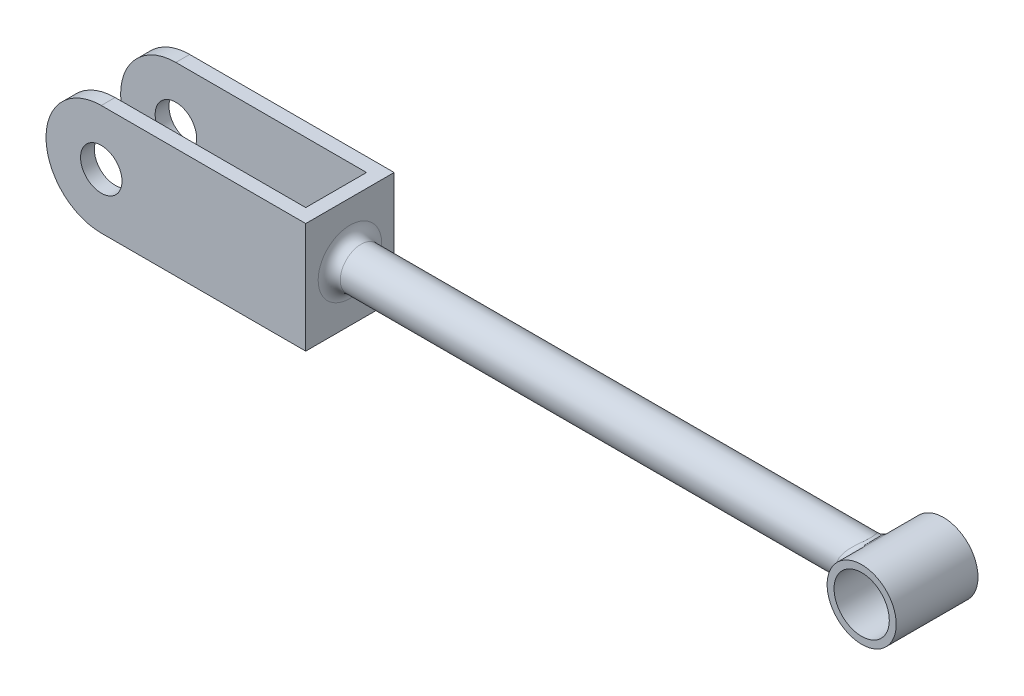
ISO-10303-21;
HEADER;
FILE_DESCRIPTION(('STEP AP214'),'2;1');
FILE_NAME('part.step','',(''),(''),'','','');
FILE_SCHEMA(('AUTOMOTIVE_DESIGN { 1 0 10303 214 1 1 1 1 }'));
ENDSEC;
DATA;
#1=APPLICATION_CONTEXT('core data for automotive mechanical design processes');
#2=APPLICATION_PROTOCOL_DEFINITION('international standard','automotive_design',2000,#1);
#3=PRODUCT_CONTEXT('',#1,'mechanical');
#4=PRODUCT('Part','Part','',(#3));
#5=PRODUCT_RELATED_PRODUCT_CATEGORY('part','',(#4));
#6=PRODUCT_DEFINITION_FORMATION('','',#4);
#7=PRODUCT_DEFINITION_CONTEXT('part definition',#1,'design');
#8=PRODUCT_DEFINITION('design','',#6,#7);
#9=PRODUCT_DEFINITION_SHAPE('','',#8);
#10=(LENGTH_UNIT() NAMED_UNIT(*) SI_UNIT(.MILLI.,.METRE.));
#11=(NAMED_UNIT(*) PLANE_ANGLE_UNIT() SI_UNIT($,.RADIAN.));
#12=(NAMED_UNIT(*) SI_UNIT($,.STERADIAN.) SOLID_ANGLE_UNIT());
#13=UNCERTAINTY_MEASURE_WITH_UNIT(LENGTH_MEASURE(1.E-05),#10,'distance_accuracy_value','');
#14=(GEOMETRIC_REPRESENTATION_CONTEXT(3) GLOBAL_UNCERTAINTY_ASSIGNED_CONTEXT((#13)) GLOBAL_UNIT_ASSIGNED_CONTEXT((#10,
#11,#12)) REPRESENTATION_CONTEXT('',''));
#15=CARTESIAN_POINT('',(0.,0.,0.));
#16=DIRECTION('',(0.,0.,1.));
#17=DIRECTION('',(1.,0.,0.));
#18=AXIS2_PLACEMENT_3D('',#15,#16,#17);
#19=CARTESIAN_POINT('',(0.,-6.35,5.08));
#20=DIRECTION('',(-1.,0.,0.));
#21=DIRECTION('',(0.,0.,1.));
#22=AXIS2_PLACEMENT_3D('',#19,#20,#21);
#23=PLANE('',#22);
#24=CARTESIAN_POINT('',(0.,0.,0.));
#25=DIRECTION('',(-1.,0.,0.));
#26=DIRECTION('',(0.,0.,1.));
#27=AXIS2_PLACEMENT_3D('',#24,#25,#26);
#28=CIRCLE('',#27,3.65125);
#29=CARTESIAN_POINT('',(0.,0.,3.65125));
#30=VERTEX_POINT('',#29);
#31=EDGE_CURVE('E11',#30,#30,#28,.T.);
#32=ORIENTED_EDGE('',*,*,#31,.T.);
#33=EDGE_LOOP('',(#32));
#34=FACE_BOUND('',#33,.T.);
#35=DIRECTION('',(0.,1.,0.));
#36=VECTOR('',#35,1.);
#37=CARTESIAN_POINT('',(0.,-6.35,-5.08));
#38=LINE('',#37,#36);
#39=CARTESIAN_POINT('',(0.,-6.35,-5.08));
#40=VERTEX_POINT('',#39);
#41=CARTESIAN_POINT('',(0.,6.35,-5.08));
#42=VERTEX_POINT('',#41);
#43=EDGE_CURVE('E143',#40,#42,#38,.T.);
#44=ORIENTED_EDGE('',*,*,#43,.T.);
#45=DIRECTION('',(0.,0.,-1.));
#46=VECTOR('',#45,1.);
#47=CARTESIAN_POINT('',(0.,6.35,5.08));
#48=LINE('',#47,#46);
#49=CARTESIAN_POINT('',(0.,6.35,5.08));
#50=VERTEX_POINT('',#49);
#51=EDGE_CURVE('E170',#50,#42,#48,.T.);
#52=ORIENTED_EDGE('',*,*,#51,.F.);
#53=DIRECTION('',(0.,1.,0.));
#54=VECTOR('',#53,1.);
#55=CARTESIAN_POINT('',(0.,-6.35,5.08));
#56=LINE('',#55,#54);
#57=CARTESIAN_POINT('',(0.,-6.35,5.08));
#58=VERTEX_POINT('',#57);
#59=EDGE_CURVE('E153',#58,#50,#56,.T.);
#60=ORIENTED_EDGE('',*,*,#59,.F.);
#61=DIRECTION('',(0.,0.,-1.));
#62=VECTOR('',#61,1.);
#63=CARTESIAN_POINT('',(0.,-6.35,5.08));
#64=LINE('',#63,#62);
#65=EDGE_CURVE('E160',#58,#40,#64,.T.);
#66=ORIENTED_EDGE('',*,*,#65,.T.);
#67=EDGE_LOOP('',(#44,#52,#60,#66));
#68=FACE_BOUND('',#67,.T.);
#69=ADVANCED_FACE('F32',(#34,#68),#23,.F.);
#70=CARTESIAN_POINT('',(-23.495,0.,5.08));
#71=DIRECTION('',(0.,0.,-1.));
#72=DIRECTION('',(-1.,0.,0.));
#73=AXIS2_PLACEMENT_3D('',#70,#71,#72);
#74=CYLINDRICAL_SURFACE('',#73,6.35);
#75=DIRECTION('',(0.,0.,-1.));
#76=VECTOR('',#75,1.);
#77=CARTESIAN_POINT('',(-23.495,6.35000000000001,5.08));
#78=LINE('',#77,#76);
#79=CARTESIAN_POINT('',(-23.495,6.35000000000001,5.08));
#80=VERTEX_POINT('',#79);
#81=CARTESIAN_POINT('',(-23.495,6.35,3.4925));
#82=VERTEX_POINT('',#81);
#83=EDGE_CURVE('E167',#80,#82,#78,.T.);
#84=ORIENTED_EDGE('',*,*,#83,.T.);
#85=CARTESIAN_POINT('',(-23.495,0.,3.4925));
#86=DIRECTION('',(0.,0.,1.));
#87=DIRECTION('',(1.,0.,0.));
#88=AXIS2_PLACEMENT_3D('',#85,#86,#87);
#89=CIRCLE('',#88,6.35);
#90=CARTESIAN_POINT('',(-23.495,-6.35,3.4925));
#91=VERTEX_POINT('',#90);
#92=EDGE_CURVE('E135',#82,#91,#89,.T.);
#93=ORIENTED_EDGE('',*,*,#92,.T.);
#94=DIRECTION('',(0.,0.,-1.));
#95=VECTOR('',#94,1.);
#96=CARTESIAN_POINT('',(-23.495,-6.34999999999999,5.08));
#97=LINE('',#96,#95);
#98=CARTESIAN_POINT('',(-23.495,-6.34999999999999,5.08));
#99=VERTEX_POINT('',#98);
#100=EDGE_CURVE('E164',#99,#91,#97,.T.);
#101=ORIENTED_EDGE('',*,*,#100,.F.);
#102=CARTESIAN_POINT('',(-23.495,0.,5.08));
#103=DIRECTION('',(0.,0.,1.));
#104=DIRECTION('',(1.,0.,0.));
#105=AXIS2_PLACEMENT_3D('',#102,#103,#104);
#106=CIRCLE('',#105,6.35);
#107=EDGE_CURVE('E157',#80,#99,#106,.T.);
#108=ORIENTED_EDGE('',*,*,#107,.F.);
#109=EDGE_LOOP('',(#84,#93,#101,#108));
#110=FACE_BOUND('',#109,.T.);
#111=ADVANCED_FACE('F230',(#110),#74,.T.);
#112=CARTESIAN_POINT('',(-23.495,0.,5.08));
#113=DIRECTION('',(0.,0.,-1.));
#114=DIRECTION('',(-1.,0.,0.));
#115=AXIS2_PLACEMENT_3D('',#112,#113,#114);
#116=CYLINDRICAL_SURFACE('',#115,2.38125);
#117=CARTESIAN_POINT('',(-23.495,0.,3.4925));
#118=DIRECTION('',(0.,0.,1.));
#119=DIRECTION('',(1.,0.,0.));
#120=AXIS2_PLACEMENT_3D('',#117,#118,#119);
#121=CIRCLE('',#120,2.38125);
#122=CARTESIAN_POINT('',(-21.11375,0.,3.4925));
#123=VERTEX_POINT('',#122);
#124=EDGE_CURVE('E134',#123,#123,#121,.T.);
#125=ORIENTED_EDGE('',*,*,#124,.F.);
#126=EDGE_LOOP('',(#125));
#127=FACE_BOUND('',#126,.T.);
#128=CARTESIAN_POINT('',(-23.495,0.,5.08));
#129=DIRECTION('',(0.,0.,1.));
#130=DIRECTION('',(1.,0.,0.));
#131=AXIS2_PLACEMENT_3D('',#128,#129,#130);
#132=CIRCLE('',#131,2.38125);
#133=CARTESIAN_POINT('',(-21.11375,0.,5.08));
#134=VERTEX_POINT('',#133);
#135=EDGE_CURVE('E140',#134,#134,#132,.T.);
#136=ORIENTED_EDGE('',*,*,#135,.T.);
#137=EDGE_LOOP('',(#136));
#138=FACE_BOUND('',#137,.T.);
#139=ADVANCED_FACE('F235',(#127,#138),#116,.F.);
#140=CARTESIAN_POINT('',(-23.495,0.,5.08));
#141=DIRECTION('',(0.,0.,1.));
#142=DIRECTION('',(1.,0.,0.));
#143=AXIS2_PLACEMENT_3D('',#140,#141,#142);
#144=PLANE('',#143);
#145=ORIENTED_EDGE('',*,*,#59,.T.);
#146=DIRECTION('',(-1.,0.,0.));
#147=VECTOR('',#146,1.);
#148=CARTESIAN_POINT('',(0.,6.35,5.08));
#149=LINE('',#148,#147);
#150=EDGE_CURVE('E155',#50,#80,#149,.T.);
#151=ORIENTED_EDGE('',*,*,#150,.T.);
#152=ORIENTED_EDGE('',*,*,#107,.T.);
#153=DIRECTION('',(1.,0.,0.));
#154=VECTOR('',#153,1.);
#155=CARTESIAN_POINT('',(-23.495,-6.34999999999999,5.08));
#156=LINE('',#155,#154);
#157=EDGE_CURVE('E56',#99,#58,#156,.T.);
#158=ORIENTED_EDGE('',*,*,#157,.T.);
#159=EDGE_LOOP('',(#145,#151,#152,#158));
#160=FACE_BOUND('',#159,.T.);
#161=ORIENTED_EDGE('',*,*,#135,.F.);
#162=EDGE_LOOP('',(#161));
#163=FACE_BOUND('',#162,.T.);
#164=ADVANCED_FACE('F251',(#160,#163),#144,.T.);
#165=CARTESIAN_POINT('',(-23.495,0.,-5.08));
#166=DIRECTION('',(0.,0.,1.));
#167=DIRECTION('',(1.,0.,0.));
#168=AXIS2_PLACEMENT_3D('',#165,#166,#167);
#169=PLANE('',#168);
#170=ORIENTED_EDGE('',*,*,#43,.F.);
#171=DIRECTION('',(1.,0.,0.));
#172=VECTOR('',#171,1.);
#173=CARTESIAN_POINT('',(-23.495,-6.34999999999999,-5.08));
#174=LINE('',#173,#172);
#175=CARTESIAN_POINT('',(-23.495,-6.34999999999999,-5.08));
#176=VERTEX_POINT('',#175);
#177=EDGE_CURVE('E151',#176,#40,#174,.T.);
#178=ORIENTED_EDGE('',*,*,#177,.F.);
#179=CARTESIAN_POINT('',(-23.495,0.,-5.08));
#180=DIRECTION('',(0.,0.,1.));
#181=DIRECTION('',(1.,0.,0.));
#182=AXIS2_PLACEMENT_3D('',#179,#180,#181);
#183=CIRCLE('',#182,6.35);
#184=CARTESIAN_POINT('',(-23.495,6.35000000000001,-5.08));
#185=VERTEX_POINT('',#184);
#186=EDGE_CURVE('E148',#185,#176,#183,.T.);
#187=ORIENTED_EDGE('',*,*,#186,.F.);
#188=DIRECTION('',(-1.,0.,0.));
#189=VECTOR('',#188,1.);
#190=CARTESIAN_POINT('',(0.,6.35,-5.08));
#191=LINE('',#190,#189);
#192=EDGE_CURVE('E146',#42,#185,#191,.T.);
#193=ORIENTED_EDGE('',*,*,#192,.F.);
#194=EDGE_LOOP('',(#170,#178,#187,#193));
#195=FACE_BOUND('',#194,.T.);
#196=CARTESIAN_POINT('',(-23.495,0.,-5.08));
#197=DIRECTION('',(0.,0.,1.));
#198=DIRECTION('',(1.,0.,0.));
#199=AXIS2_PLACEMENT_3D('',#196,#197,#198);
#200=CIRCLE('',#199,2.38125);
#201=CARTESIAN_POINT('',(-21.11375,0.,-5.08));
#202=VERTEX_POINT('',#201);
#203=EDGE_CURVE('E137',#202,#202,#200,.T.);
#204=ORIENTED_EDGE('',*,*,#203,.T.);
#205=EDGE_LOOP('',(#204));
#206=FACE_BOUND('',#205,.T.);
#207=ADVANCED_FACE('F242',(#195,#206),#169,.F.);
#208=CARTESIAN_POINT('',(0.,6.35,5.08));
#209=DIRECTION('',(0.,-1.,0.));
#210=DIRECTION('',(1.,0.,0.));
#211=AXIS2_PLACEMENT_3D('',#208,#209,#210);
#212=PLANE('',#211);
#213=DIRECTION('',(0.,0.,-1.));
#214=VECTOR('',#213,1.);
#215=CARTESIAN_POINT('',(-1.5875,6.35,3.4925));
#216=LINE('',#215,#214);
#217=CARTESIAN_POINT('',(-1.5875,6.35,3.4925));
#218=VERTEX_POINT('',#217);
#219=CARTESIAN_POINT('',(-1.5875,6.35,-3.4925));
#220=VERTEX_POINT('',#219);
#221=EDGE_CURVE('E112',#218,#220,#216,.T.);
#222=ORIENTED_EDGE('',*,*,#221,.F.);
#223=DIRECTION('',(1.,0.,0.));
#224=VECTOR('',#223,1.);
#225=CARTESIAN_POINT('',(-29.845,6.35,3.4925));
#226=LINE('',#225,#224);
#227=EDGE_CURVE('E121',#82,#218,#226,.T.);
#228=ORIENTED_EDGE('',*,*,#227,.F.);
#229=ORIENTED_EDGE('',*,*,#83,.F.);
#230=ORIENTED_EDGE('',*,*,#150,.F.);
#231=ORIENTED_EDGE('',*,*,#51,.T.);
#232=ORIENTED_EDGE('',*,*,#192,.T.);
#233=CARTESIAN_POINT('',(-23.495,6.35,-3.4925));
#234=VERTEX_POINT('',#233);
#235=EDGE_CURVE('E120',#234,#185,#78,.T.);
#236=ORIENTED_EDGE('',*,*,#235,.F.);
#237=DIRECTION('',(-1.,0.,0.));
#238=VECTOR('',#237,1.);
#239=CARTESIAN_POINT('',(-1.5875,6.35,-3.4925));
#240=LINE('',#239,#238);
#241=EDGE_CURVE('E101',#220,#234,#240,.T.);
#242=ORIENTED_EDGE('',*,*,#241,.F.);
#243=EDGE_LOOP('',(#222,#228,#229,#230,#231,#232,#236,#242));
#244=FACE_BOUND('',#243,.T.);
#245=ADVANCED_FACE('F118',(#244),#212,.F.);
#246=CARTESIAN_POINT('',(-23.495,0.,-3.4925));
#247=DIRECTION('',(0.,0.,-1.));
#248=DIRECTION('',(-1.,0.,0.));
#249=AXIS2_PLACEMENT_3D('',#246,#247,#248);
#250=CIRCLE('',#249,6.35);
#251=CARTESIAN_POINT('',(-23.495,-6.34999999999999,-3.4925));
#252=VERTEX_POINT('',#251);
#253=EDGE_CURVE('E48',#252,#234,#250,.T.);
#254=ORIENTED_EDGE('',*,*,#253,.T.);
#255=ORIENTED_EDGE('',*,*,#235,.T.);
#256=ORIENTED_EDGE('',*,*,#186,.T.);
#257=EDGE_CURVE('E163',#252,#176,#97,.T.);
#258=ORIENTED_EDGE('',*,*,#257,.F.);
#259=EDGE_LOOP('',(#254,#255,#256,#258));
#260=FACE_BOUND('',#259,.T.);
#261=ADVANCED_FACE('F238',(#260),#74,.T.);
#262=CARTESIAN_POINT('',(-23.495,-6.34999999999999,5.08));
#263=DIRECTION('',(0.,1.,0.));
#264=DIRECTION('',(-1.,0.,0.));
#265=AXIS2_PLACEMENT_3D('',#262,#263,#264);
#266=PLANE('',#265);
#267=ORIENTED_EDGE('',*,*,#100,.T.);
#268=DIRECTION('',(1.,0.,0.));
#269=VECTOR('',#268,1.);
#270=CARTESIAN_POINT('',(-29.845,-6.35,3.4925));
#271=LINE('',#270,#269);
#272=CARTESIAN_POINT('',(-1.5875,-6.35,3.4925));
#273=VERTEX_POINT('',#272);
#274=EDGE_CURVE('E108',#91,#273,#271,.T.);
#275=ORIENTED_EDGE('',*,*,#274,.T.);
#276=DIRECTION('',(0.,0.,-1.));
#277=VECTOR('',#276,1.);
#278=CARTESIAN_POINT('',(-1.5875,-6.35,3.4925));
#279=LINE('',#278,#277);
#280=CARTESIAN_POINT('',(-1.5875,-6.35,-3.4925));
#281=VERTEX_POINT('',#280);
#282=EDGE_CURVE('E123',#273,#281,#279,.T.);
#283=ORIENTED_EDGE('',*,*,#282,.T.);
#284=DIRECTION('',(-1.,0.,0.));
#285=VECTOR('',#284,1.);
#286=CARTESIAN_POINT('',(-1.5875,-6.35,-3.4925));
#287=LINE('',#286,#285);
#288=EDGE_CURVE('E103',#281,#252,#287,.T.);
#289=ORIENTED_EDGE('',*,*,#288,.T.);
#290=ORIENTED_EDGE('',*,*,#257,.T.);
#291=ORIENTED_EDGE('',*,*,#177,.T.);
#292=ORIENTED_EDGE('',*,*,#65,.F.);
#293=ORIENTED_EDGE('',*,*,#157,.F.);
#294=EDGE_LOOP('',(#267,#275,#283,#289,#290,#291,#292,#293));
#295=FACE_BOUND('',#294,.T.);
#296=ADVANCED_FACE('F245',(#295),#266,.F.);
#297=CARTESIAN_POINT('',(-23.495,0.,-3.4925));
#298=DIRECTION('',(0.,0.,-1.));
#299=DIRECTION('',(-1.,0.,0.));
#300=AXIS2_PLACEMENT_3D('',#297,#298,#299);
#301=CIRCLE('',#300,2.38125);
#302=CARTESIAN_POINT('',(-25.87625,0.,-3.4925));
#303=VERTEX_POINT('',#302);
#304=EDGE_CURVE('E131',#303,#303,#301,.T.);
#305=ORIENTED_EDGE('',*,*,#304,.F.);
#306=EDGE_LOOP('',(#305));
#307=FACE_BOUND('',#306,.T.);
#308=ORIENTED_EDGE('',*,*,#203,.F.);
#309=EDGE_LOOP('',(#308));
#310=FACE_BOUND('',#309,.T.);
#311=ADVANCED_FACE('F249',(#307,#310),#116,.F.);
#312=CARTESIAN_POINT('',(-29.845,-6.35,3.4925));
#313=DIRECTION('',(0.,0.,1.));
#314=DIRECTION('',(1.,0.,0.));
#315=AXIS2_PLACEMENT_3D('',#312,#313,#314);
#316=PLANE('',#315);
#317=ORIENTED_EDGE('',*,*,#124,.T.);
#318=EDGE_LOOP('',(#317));
#319=FACE_BOUND('',#318,.T.);
#320=ORIENTED_EDGE('',*,*,#227,.T.);
#321=DIRECTION('',(0.,1.,0.));
#322=VECTOR('',#321,1.);
#323=CARTESIAN_POINT('',(-1.5875,-6.35,3.4925));
#324=LINE('',#323,#322);
#325=EDGE_CURVE('E107',#273,#218,#324,.T.);
#326=ORIENTED_EDGE('',*,*,#325,.F.);
#327=ORIENTED_EDGE('',*,*,#274,.F.);
#328=ORIENTED_EDGE('',*,*,#92,.F.);
#329=EDGE_LOOP('',(#320,#326,#327,#328));
#330=FACE_BOUND('',#329,.T.);
#331=ADVANCED_FACE('F259',(#319,#330),#316,.F.);
#332=CARTESIAN_POINT('',(-1.5875,-6.35,-3.4925));
#333=DIRECTION('',(0.,0.,-1.));
#334=DIRECTION('',(-1.,0.,0.));
#335=AXIS2_PLACEMENT_3D('',#332,#333,#334);
#336=PLANE('',#335);
#337=ORIENTED_EDGE('',*,*,#304,.T.);
#338=EDGE_LOOP('',(#337));
#339=FACE_BOUND('',#338,.T.);
#340=ORIENTED_EDGE('',*,*,#253,.F.);
#341=ORIENTED_EDGE('',*,*,#288,.F.);
#342=DIRECTION('',(0.,1.,0.));
#343=VECTOR('',#342,1.);
#344=CARTESIAN_POINT('',(-1.5875,-6.35,-3.4925));
#345=LINE('',#344,#343);
#346=EDGE_CURVE('E97',#281,#220,#345,.T.);
#347=ORIENTED_EDGE('',*,*,#346,.T.);
#348=ORIENTED_EDGE('',*,*,#241,.T.);
#349=EDGE_LOOP('',(#340,#341,#347,#348));
#350=FACE_BOUND('',#349,.T.);
#351=ADVANCED_FACE('F99',(#339,#350),#336,.F.);
#352=CARTESIAN_POINT('',(-1.5875,-6.35,3.4925));
#353=DIRECTION('',(1.,0.,0.));
#354=DIRECTION('',(0.,1.,0.));
#355=AXIS2_PLACEMENT_3D('',#352,#353,#354);
#356=PLANE('',#355);
#357=ORIENTED_EDGE('',*,*,#221,.T.);
#358=ORIENTED_EDGE('',*,*,#346,.F.);
#359=ORIENTED_EDGE('',*,*,#282,.F.);
#360=ORIENTED_EDGE('',*,*,#325,.T.);
#361=EDGE_LOOP('',(#357,#358,#359,#360));
#362=FACE_BOUND('',#361,.T.);
#363=ADVANCED_FACE('F113',(#362),#356,.F.);
#364=CARTESIAN_POINT('',(500000.,0.,0.));
#365=DIRECTION('',(-1.,0.,0.));
#366=DIRECTION('',(0.,0.,1.));
#367=AXIS2_PLACEMENT_3D('',#364,#365,#366);
#368=CYLINDRICAL_SURFACE('',#367,2.38125);
#369=CARTESIAN_POINT('',(58.2709890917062,-0.208232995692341,2.37212785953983));
#370=CARTESIAN_POINT('',(59.5319077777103,-0.131828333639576,2.37883490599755));
#371=CARTESIAN_POINT('',(59.5386280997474,-0.241886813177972,3.63726271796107));
#372=CARTESIAN_POINT('',(58.260263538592,-0.0936722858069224,2.38218402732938));
#373=CARTESIAN_POINT('',(59.5311098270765,-0.057961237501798,2.38160074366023));
#374=CARTESIAN_POINT('',(59.5305026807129,-0.108811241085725,3.65268217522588));
#375=CARTESIAN_POINT('',(58.2583906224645,0.0219828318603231,2.38392963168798));
#376=CARTESIAN_POINT('',(59.5310409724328,0.0132069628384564,2.38198214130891));
#377=CARTESIAN_POINT('',(59.5290838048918,0.0255356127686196,3.65535876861));
#378=CARTESIAN_POINT('',(58.2725269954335,0.25186834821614,2.37069041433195));
#379=CARTESIAN_POINT('',(59.5319989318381,0.159137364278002,2.37847493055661));
#380=CARTESIAN_POINT('',(59.5397931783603,0.292574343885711,3.6350586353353));
#381=CARTESIAN_POINT('',(58.2885396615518,0.366098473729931,2.35570243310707));
#382=CARTESIAN_POINT('',(59.5330170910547,0.233176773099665,2.37461895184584));
#383=CARTESIAN_POINT('',(59.5519239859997,0.425265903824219,3.61207706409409));
#384=CARTESIAN_POINT('',(58.3360016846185,0.585250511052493,2.31081242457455));
#385=CARTESIAN_POINT('',(59.5386916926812,0.386873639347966,2.35933572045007));
#386=CARTESIAN_POINT('',(59.5878800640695,0.679836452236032,3.54324571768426));
#387=CARTESIAN_POINT('',(58.3668075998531,0.690361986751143,2.28153128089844));
#388=CARTESIAN_POINT('',(59.5431358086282,0.465474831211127,2.34836778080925));
#389=CARTESIAN_POINT('',(59.6112178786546,0.80193564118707,3.4983479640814));
#390=CARTESIAN_POINT('',(58.4411821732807,0.893888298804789,2.20974440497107));
#391=CARTESIAN_POINT('',(59.5585884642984,0.631024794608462,2.31472912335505));
#392=CARTESIAN_POINT('',(59.6675622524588,1.03835509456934,3.38827475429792));
#393=CARTESIAN_POINT('',(58.4847532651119,0.992301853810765,2.16723615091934));
#394=CARTESIAN_POINT('',(59.5694389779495,0.71738718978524,2.29235621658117));
#395=CARTESIAN_POINT('',(59.7005706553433,1.15267387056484,3.32309543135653));
#396=CARTESIAN_POINT('',(58.5864196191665,1.1899596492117,2.06587688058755));
#397=CARTESIAN_POINT('',(59.6010898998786,0.903660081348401,2.22968579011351));
#398=CARTESIAN_POINT('',(59.7775906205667,1.38227636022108,3.16767788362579));
#399=CARTESIAN_POINT('',(58.6455071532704,1.28837811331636,2.00584937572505));
#400=CARTESIAN_POINT('',(59.6224931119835,1.00381365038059,2.18832513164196));
#401=CARTESIAN_POINT('',(59.8223539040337,1.49660083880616,3.07563570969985));
#402=CARTESIAN_POINT('',(58.7715019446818,1.47427643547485,1.8734735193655));
#403=CARTESIAN_POINT('',(59.6756463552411,1.20435297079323,2.08536613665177));
#404=CARTESIAN_POINT('',(59.9178045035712,1.7125433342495,2.87265939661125));
#405=CARTESIAN_POINT('',(58.8384166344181,1.56174573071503,1.80111342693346));
#406=CARTESIAN_POINT('',(59.7071203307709,1.30462894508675,2.02430722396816));
#407=CARTESIAN_POINT('',(59.9684974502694,1.81414908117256,2.76170725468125));
#408=CARTESIAN_POINT('',(58.9474371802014,1.6913499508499,1.67752497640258));
#409=CARTESIAN_POINT('',(59.76371146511,1.45997470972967,1.91085127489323));
#410=CARTESIAN_POINT('',(60.0510887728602,1.96469943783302,2.57220496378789));
#411=CARTESIAN_POINT('',(58.9884283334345,1.73733500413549,1.62984456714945));
#412=CARTESIAN_POINT('',(59.7859046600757,1.51627290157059,1.86567753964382));
#413=CARTESIAN_POINT('',(60.0821426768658,2.01811641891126,2.499095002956));
#414=CARTESIAN_POINT('',(59.0706382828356,1.82509397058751,1.53093161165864));
#415=CARTESIAN_POINT('',(59.8322220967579,1.62576644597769,1.7687260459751));
#416=CARTESIAN_POINT('',(60.1444229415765,2.12005865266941,2.34742847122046));
#417=CARTESIAN_POINT('',(59.1118568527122,1.86687147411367,1.47970215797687));
#418=CARTESIAN_POINT('',(59.8563310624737,1.67903666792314,1.71701734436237));
#419=CARTESIAN_POINT('',(60.1756491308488,2.16858807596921,2.26887664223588));
#420=CARTESIAN_POINT('',(59.234519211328,1.98581949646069,1.32075566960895));
#421=CARTESIAN_POINT('',(59.9299305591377,1.83200022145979,1.55315866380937));
#422=CARTESIAN_POINT('',(60.2685751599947,2.30676002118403,2.02515869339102));
#423=CARTESIAN_POINT('',(59.3149770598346,2.05661398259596,1.20777243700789));
#424=CARTESIAN_POINT('',(59.9816762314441,1.92735872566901,1.43038088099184));
#425=CARTESIAN_POINT('',(60.3295280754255,2.3889960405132,1.85191773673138));
#426=CARTESIAN_POINT('',(59.4502058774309,2.16825711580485,0.990512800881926));
#427=CARTESIAN_POINT('',(60.0718520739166,2.08000383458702,1.18551734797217));
#428=CARTESIAN_POINT('',(60.4319741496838,2.5186825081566,1.51878629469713));
#429=CARTESIAN_POINT('',(59.5069909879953,2.21220578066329,0.888355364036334));
#430=CARTESIAN_POINT('',(60.1110722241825,2.14137639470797,1.06756271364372));
#431=CARTESIAN_POINT('',(60.4749931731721,2.56973398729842,1.36214489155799));
#432=CARTESIAN_POINT('',(59.6058735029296,2.28595545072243,0.676237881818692));
#433=CARTESIAN_POINT('',(60.1803523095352,2.24485946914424,0.818508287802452));
#434=CARTESIAN_POINT('',(60.5499041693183,2.65540279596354,1.03689808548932));
#435=CARTESIAN_POINT('',(59.6480016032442,2.31578607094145,0.566294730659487));
#436=CARTESIAN_POINT('',(60.2106938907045,2.28747148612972,0.687063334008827));
#437=CARTESIAN_POINT('',(60.5818193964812,2.69005452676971,0.868318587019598));
#438=CARTESIAN_POINT('',(59.706021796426,2.35612352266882,0.358362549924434));
#439=CARTESIAN_POINT('',(60.2526356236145,2.34506795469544,0.436446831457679));
#440=CARTESIAN_POINT('',(60.6257740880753,2.73691116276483,0.549489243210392));
#441=CARTESIAN_POINT('',(59.7249865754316,2.36892280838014,0.261192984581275));
#442=CARTESIAN_POINT('',(60.2665600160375,2.36352630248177,0.318264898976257));
#443=CARTESIAN_POINT('',(60.6401413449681,2.75177901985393,0.4004959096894));
#444=CARTESIAN_POINT('',(59.7449364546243,2.38237550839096,0.0652585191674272));
#445=CARTESIAN_POINT('',(60.281151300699,2.38285004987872,0.0797731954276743));
#446=CARTESIAN_POINT('',(60.6552548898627,2.76740589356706,0.100063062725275));
#447=CARTESIAN_POINT('',(59.7459354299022,2.38303829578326,-0.0335050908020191));
#448=CARTESIAN_POINT('',(60.2818895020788,2.38380999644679,-0.0410269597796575));
#449=CARTESIAN_POINT('',(60.6560116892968,2.76817579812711,-0.0513744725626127));
#450=CARTESIAN_POINT('',(59.7298232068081,2.3721905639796,-0.229562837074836));
#451=CARTESIAN_POINT('',(60.2700984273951,2.36822213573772,-0.279784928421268));
#452=CARTESIAN_POINT('',(60.6438054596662,2.755574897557,-0.351996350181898));
#453=CARTESIAN_POINT('',(59.7127348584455,2.36069540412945,-0.326858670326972));
#454=CARTESIAN_POINT('',(60.2575362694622,2.35163087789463,-0.398243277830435));
#455=CARTESIAN_POINT('',(60.6308597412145,2.74222193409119,-0.501183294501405));
#456=CARTESIAN_POINT('',(59.6630561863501,2.32631856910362,-0.517715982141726));
#457=CARTESIAN_POINT('',(60.2215736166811,2.30252748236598,-0.628540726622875));
#458=CARTESIAN_POINT('',(60.5932243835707,2.70228924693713,-0.793831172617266));
#459=CARTESIAN_POINT('',(59.6304436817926,2.30342059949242,-0.611271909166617));
#460=CARTESIAN_POINT('',(60.1980235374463,2.26980279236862,-0.740774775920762));
#461=CARTESIAN_POINT('',(60.5685179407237,2.67569059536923,-0.937283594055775));
#462=CARTESIAN_POINT('',(59.5396525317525,2.23708828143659,-0.826222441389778));
#463=CARTESIAN_POINT('',(60.1337089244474,2.1760769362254,-0.995542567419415));
#464=CARTESIAN_POINT('',(60.499736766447,2.59863790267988,-1.26687441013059));
#465=CARTESIAN_POINT('',(59.4764881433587,2.1892111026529,-0.945339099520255));
#466=CARTESIAN_POINT('',(60.0895912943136,2.1087447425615,-1.13419912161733));
#467=CARTESIAN_POINT('',(60.4518849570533,2.54302299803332,-1.44951995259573));
#468=CARTESIAN_POINT('',(59.3385324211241,2.07663039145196,-1.1722073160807));
#469=CARTESIAN_POINT('',(59.9971686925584,1.95458190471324,-1.39080703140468));
#470=CARTESIAN_POINT('',(60.3473730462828,2.41224742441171,-1.79738455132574));
#471=CARTESIAN_POINT('',(59.2637200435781,2.01189625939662,-1.27993770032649));
#472=CARTESIAN_POINT('',(59.948556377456,1.86697304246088,-1.50892559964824));
#473=CARTESIAN_POINT('',(60.2906970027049,2.33705121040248,-1.96257114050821));
#474=CARTESIAN_POINT('',(59.1087418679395,1.86530930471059,-1.48568890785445));
#475=CARTESIAN_POINT('',(59.8534227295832,1.67549887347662,-1.72535172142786));
#476=CARTESIAN_POINT('',(60.1732892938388,2.16677343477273,-2.27805632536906));
#477=CARTESIAN_POINT('',(59.0284919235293,1.78309255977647,-1.58342480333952));
#478=CARTESIAN_POINT('',(59.806919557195,1.57066172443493,-1.82287618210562));
#479=CARTESIAN_POINT('',(60.1124938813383,2.07126913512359,-2.42791803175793));
#480=CARTESIAN_POINT('',(58.9107188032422,1.64850346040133,-1.71954989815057));
#481=CARTESIAN_POINT('',(59.7444429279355,1.40851686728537,-1.94973843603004));
#482=CARTESIAN_POINT('',(60.0232718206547,1.91492826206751,-2.63664317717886));
#483=CARTESIAN_POINT('',(58.8719078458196,1.60178140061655,-1.76316505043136));
#484=CARTESIAN_POINT('',(59.7246564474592,1.35304262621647,-1.98911049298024));
#485=CARTESIAN_POINT('',(59.9938695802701,1.8606551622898,-2.70351974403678));
#486=CARTESIAN_POINT('',(58.7958483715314,1.50459573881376,-1.84679718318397));
#487=CARTESIAN_POINT('',(59.6877871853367,1.24082222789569,-2.06169764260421));
#488=CARTESIAN_POINT('',(59.9362487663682,1.74776272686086,-2.83175568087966));
#489=CARTESIAN_POINT('',(58.7586018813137,1.45412750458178,-1.88680956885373));
#490=CARTESIAN_POINT('',(59.6707469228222,1.18405523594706,-2.09481583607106));
#491=CARTESIAN_POINT('',(59.9080317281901,1.68913801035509,-2.89310800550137));
#492=CARTESIAN_POINT('',(58.654702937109,1.30351490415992,-1.99649512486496));
#493=CARTESIAN_POINT('',(59.625869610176,1.01915353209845,-2.18184804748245));
#494=CARTESIAN_POINT('',(59.8293204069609,1.51418397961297,-3.06129252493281));
#495=CARTESIAN_POINT('',(58.5910570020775,1.1987815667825,-2.06123899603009));
#496=CARTESIAN_POINT('',(59.6025490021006,0.911885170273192,-2.22681112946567));
#497=CARTESIAN_POINT('',(59.7811037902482,1.39252404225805,-3.16056646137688));
#498=CARTESIAN_POINT('',(58.4773755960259,0.978148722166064,-2.17460576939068));
#499=CARTESIAN_POINT('',(59.5670343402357,0.703602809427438,-2.29710265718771));
#500=CARTESIAN_POINT('',(59.6949815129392,1.13623336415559,-3.33439551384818));
#501=CARTESIAN_POINT('',(58.4273206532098,0.86226551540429,-2.22325175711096));
#502=CARTESIAN_POINT('',(59.5551921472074,0.603183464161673,-2.32179412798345));
#503=CARTESIAN_POINT('',(59.6570611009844,1.00162155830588,-3.40898602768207));
#504=CARTESIAN_POINT('',(58.350423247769,0.636888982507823,-2.29716759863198));
#505=CARTESIAN_POINT('',(59.5404562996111,0.424613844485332,-2.35467720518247));
#506=CARTESIAN_POINT('',(59.5988054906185,0.739820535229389,-3.5223236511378));
#507=CARTESIAN_POINT('',(58.3214571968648,0.528416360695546,-2.32460371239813));
#508=CARTESIAN_POINT('',(59.5367759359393,0.345751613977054,-2.36426924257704));
#509=CARTESIAN_POINT('',(59.5768615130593,0.613816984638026,-3.56439235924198));
#510=CARTESIAN_POINT('',(58.2797468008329,0.307549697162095,-2.36395334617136));
#511=CARTESIAN_POINT('',(59.532326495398,0.194538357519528,-2.37692720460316));
#512=CARTESIAN_POINT('',(59.5452627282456,0.357254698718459,-3.62472846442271));
#513=CARTESIAN_POINT('',(58.2669601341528,0.195166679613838,-2.37590736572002));
#514=CARTESIAN_POINT('',(59.5316007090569,0.122870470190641,-2.37988494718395));
#515=CARTESIAN_POINT('',(59.535575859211,0.226708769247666,-3.64305796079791));
#516=CARTESIAN_POINT('',(58.261770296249,0.0553686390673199,-2.38076274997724));
#517=CARTESIAN_POINT('',(59.5312845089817,0.0347799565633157,-2.38112166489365));
#518=CARTESIAN_POINT('',(59.5316441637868,0.0643171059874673,-3.65050288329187));
#519=CARTESIAN_POINT('',(58.2612624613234,0.0281824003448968,-2.38123835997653));
#520=CARTESIAN_POINT('',(59.5312506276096,0.0177047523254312,-2.38124721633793));
#521=CARTESIAN_POINT('',(59.5312594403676,0.0327371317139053,-3.65123215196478));
#522=CARTESIAN_POINT('',(58.2612379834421,-0.0261915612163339,-2.38126122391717));
#523=CARTESIAN_POINT('',(59.5312493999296,-0.0164540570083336,-2.38125267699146));
#524=CARTESIAN_POINT('',(59.5312408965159,-0.0304245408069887,-3.65126721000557));
#525=CARTESIAN_POINT('',(58.261721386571,-0.0533792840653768,-2.38080843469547));
#526=CARTESIAN_POINT('',(59.5312820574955,-0.0335284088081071,-2.38113257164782));
#527=CARTESIAN_POINT('',(59.5316071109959,-0.0620062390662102,-3.65057293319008));
#528=CARTESIAN_POINT('',(58.2670473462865,-0.200328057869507,-2.37582627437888));
#529=CARTESIAN_POINT('',(59.5316026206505,-0.12610590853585,-2.37986913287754));
#530=CARTESIAN_POINT('',(59.535641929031,-0.232704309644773,-3.64293362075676));
#531=CARTESIAN_POINT('',(58.2811309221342,-0.319852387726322,-2.36266328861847));
#532=CARTESIAN_POINT('',(59.5323778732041,-0.202327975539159,-2.37664730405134));
#533=CARTESIAN_POINT('',(59.5463113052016,-0.371545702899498,-3.6227503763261));
#534=CARTESIAN_POINT('',(58.3274559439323,-0.554289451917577,-2.31892647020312));
#535=CARTESIAN_POINT('',(59.5375145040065,-0.364036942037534,-2.36231270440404));
#536=CARTESIAN_POINT('',(59.5814060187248,-0.643871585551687,-3.55568725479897));
#537=CARTESIAN_POINT('',(58.3597485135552,-0.669188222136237,-2.28830361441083));
#538=CARTESIAN_POINT('',(59.5418189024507,-0.448700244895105,-2.35133912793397));
#539=CARTESIAN_POINT('',(59.6058700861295,-0.77733985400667,-3.50873220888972));
#540=CARTESIAN_POINT('',(58.4393176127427,-0.890442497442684,-2.21158069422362));
#541=CARTESIAN_POINT('',(59.5580528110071,-0.627592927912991,-2.31580570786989));
#542=CARTESIAN_POINT('',(59.6661497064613,-1.03435239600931,-3.3910903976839));
#543=CARTESIAN_POINT('',(58.4864993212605,-0.996846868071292,-2.16557846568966));
#544=CARTESIAN_POINT('',(59.5697361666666,-0.720993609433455,-2.29170612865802));
#545=CARTESIAN_POINT('',(59.7018934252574,-1.15795343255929,-3.3205536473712));
#546=CARTESIAN_POINT('',(58.592206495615,-1.19991728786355,-2.06001421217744));
#547=CARTESIAN_POINT('',(59.6031316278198,-0.913648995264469,-2.22570964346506));
#548=CARTESIAN_POINT('',(59.7819746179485,-1.39384331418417,-3.15868845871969));
#549=CARTESIAN_POINT('',(58.6507270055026,-1.29658756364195,-2.00045810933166));
#550=CARTESIAN_POINT('',(59.6245489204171,-1.01243599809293,-2.1843474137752));
#551=CARTESIAN_POINT('',(59.8263083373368,-1.50613706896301,-3.06736910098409));
#552=CARTESIAN_POINT('',(58.7813651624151,-1.48823110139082,-1.86300094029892));
#553=CARTESIAN_POINT('',(59.6799255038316,-1.21950841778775,-2.07707127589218));
#554=CARTESIAN_POINT('',(59.9252766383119,-1.7287532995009,-2.85660144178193));
#555=CARTESIAN_POINT('',(58.8542549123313,-1.58209356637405,-1.78386890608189));
#556=CARTESIAN_POINT('',(59.7146460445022,-1.32792594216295,-2.00966414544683));
#557=CARTESIAN_POINT('',(59.9804961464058,-1.83778545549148,-2.73526565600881));
#558=CARTESIAN_POINT('',(59.0036967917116,-1.75618074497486,-1.61279577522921));
#559=CARTESIAN_POINT('',(59.7931725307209,-1.53737127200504,-1.85121641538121));
#560=CARTESIAN_POINT('',(60.0937096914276,-2.04000793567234,-2.47295352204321));
#561=CARTESIAN_POINT('',(59.080255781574,-1.83637852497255,-1.52083001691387));
#562=CARTESIAN_POINT('',(59.8368084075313,-1.63870669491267,-1.76064658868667));
#563=CARTESIAN_POINT('',(60.1517089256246,-2.13316697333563,-2.33193935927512));
#564=CARTESIAN_POINT('',(59.2433863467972,-1.99423638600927,-1.30904802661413));
#565=CARTESIAN_POINT('',(59.93525673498,-1.84278559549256,-1.54110394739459));
#566=CARTESIAN_POINT('',(60.2752926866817,-2.31653721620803,-2.00720697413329));
#567=CARTESIAN_POINT('',(59.329530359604,-2.06930326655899,-1.18713947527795));
#568=CARTESIAN_POINT('',(59.9910071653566,-1.94432649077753,-1.40809010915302));
#569=CARTESIAN_POINT('',(60.3405533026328,-2.40373611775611,-1.82028052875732));
#570=CARTESIAN_POINT('',(59.4866282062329,-2.19746676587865,-0.928535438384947));
#571=CARTESIAN_POINT('',(60.0962558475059,-2.11983938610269,-1.11552357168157));
#572=CARTESIAN_POINT('',(60.4595668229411,-2.55261290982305,-1.42375433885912));
#573=CARTESIAN_POINT('',(59.5576225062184,-2.25062227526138,-0.791880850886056));
#574=CARTESIAN_POINT('',(60.1462103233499,-2.19497883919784,-0.955744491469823));
#575=CARTESIAN_POINT('',(60.5133503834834,-2.61435920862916,-1.21421730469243));
#576=CARTESIAN_POINT('',(59.6507951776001,-2.31785503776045,-0.55457290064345));
#577=CARTESIAN_POINT('',(60.212613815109,-2.29032791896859,-0.6730267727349));
#578=CARTESIAN_POINT('',(60.5839357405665,-2.69245787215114,-0.850345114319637));
#579=CARTESIAN_POINT('',(59.6813625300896,-2.33906755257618,-0.457354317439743));
#580=CARTESIAN_POINT('',(60.2348034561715,-2.32073104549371,-0.55591256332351));
#581=CARTESIAN_POINT('',(60.6070928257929,-2.71709867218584,-0.701276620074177));
#582=CARTESIAN_POINT('',(59.7252433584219,-2.36917516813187,-0.259483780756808));
#583=CARTESIAN_POINT('',(60.2666789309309,-2.36381541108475,-0.316451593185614));
#584=CARTESIAN_POINT('',(60.6403358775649,-2.75207216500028,-0.397875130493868));
#585=CARTESIAN_POINT('',(59.7385883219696,-2.37809274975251,-0.158838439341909));
#586=CARTESIAN_POINT('',(60.2765176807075,-2.37670906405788,-0.193647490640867));
#587=CARTESIAN_POINT('',(60.6504456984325,-2.76243097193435,-0.243552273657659));
#588=CARTESIAN_POINT('',(59.7459046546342,-2.38300732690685,0.0433725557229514));
#589=CARTESIAN_POINT('',(60.2818761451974,-2.38377483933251,0.0527933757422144));
#590=CARTESIAN_POINT('',(60.6559883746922,-2.76813982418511,0.0665045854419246));
#591=CARTESIAN_POINT('',(59.7398203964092,-2.37896722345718,0.144940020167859));
#592=CARTESIAN_POINT('',(60.2773789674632,-2.37792500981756,0.176985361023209));
#593=CARTESIAN_POINT('',(60.6513790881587,-2.76344677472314,0.22224136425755));
#594=CARTESIAN_POINT('',(59.7091998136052,-2.35820026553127,0.345621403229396));
#595=CARTESIAN_POINT('',(60.2550339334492,-2.34813133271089,0.420793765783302));
#596=CARTESIAN_POINT('',(60.6281816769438,-2.73932354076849,0.529952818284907));
#597=CARTESIAN_POINT('',(59.6846372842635,-2.34145539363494,0.444731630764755));
#598=CARTESIAN_POINT('',(60.2370701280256,-2.3240314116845,0.540919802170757));
#599=CARTESIAN_POINT('',(60.6095737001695,-2.71987242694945,0.681921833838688));
#600=CARTESIAN_POINT('',(59.6133951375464,-2.29117428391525,0.660104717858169));
#601=CARTESIAN_POINT('',(60.1858790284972,-2.25246145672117,0.799213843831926));
#602=CARTESIAN_POINT('',(60.5556023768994,-2.66146507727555,1.01216056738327));
#603=CARTESIAN_POINT('',(59.5629519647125,-2.25468199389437,0.775132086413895));
#604=CARTESIAN_POINT('',(60.1498763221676,-2.20056850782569,0.935624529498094));
#605=CARTESIAN_POINT('',(60.5173878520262,-2.61907504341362,1.18853586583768));
#606=CARTESIAN_POINT('',(59.4479640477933,-2.16629442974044,0.995848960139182));
#607=CARTESIAN_POINT('',(60.0704626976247,-2.07751111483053,1.19169247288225));
#608=CARTESIAN_POINT('',(60.4302757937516,-2.51640262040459,1.5269684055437));
#609=CARTESIAN_POINT('',(59.3833985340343,-2.11437642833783,1.1015243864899));
#610=CARTESIAN_POINT('',(60.0267406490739,-2.00573380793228,1.31167103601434));
#611=CARTESIAN_POINT('',(60.381362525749,-2.45609383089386,1.68900405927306));
#612=CARTESIAN_POINT('',(59.2459811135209,-1.99539194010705,1.30497026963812));
#613=CARTESIAN_POINT('',(59.9376516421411,-1.84566661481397,1.53557072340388));
#614=CARTESIAN_POINT('',(60.2772584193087,-2.31787952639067,2.00095441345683));
#615=CARTESIAN_POINT('',(59.1729779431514,-1.9280168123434,1.40251517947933));
#616=CARTESIAN_POINT('',(59.892108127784,-1.75647094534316,1.63905898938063));
#617=CARTESIAN_POINT('',(60.2219529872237,-2.23961548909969,2.15052327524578));
#618=CARTESIAN_POINT('',(59.0261093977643,-1.7797477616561,1.58644586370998));
#619=CARTESIAN_POINT('',(59.805877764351,-1.56740252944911,1.82554294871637));
#620=CARTESIAN_POINT('',(60.1106889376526,-2.06738376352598,2.43255032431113));
#621=CARTESIAN_POINT('',(58.9522436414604,-1.69884763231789,1.67282648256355));
#622=CARTESIAN_POINT('',(59.7652087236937,-1.46703936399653,1.90825211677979));
#623=CARTESIAN_POINT('',(60.0547300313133,-1.97340886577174,2.56500060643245));
#624=CARTESIAN_POINT('',(58.7935945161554,-1.50541419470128,1.85063183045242));
#625=CARTESIAN_POINT('',(59.6848306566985,-1.23827169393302,2.06825751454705));
#626=CARTESIAN_POINT('',(59.934541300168,-1.74871345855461,2.83763547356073));
#627=CARTESIAN_POINT('',(58.7098631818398,-1.38981711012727,1.93917140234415));
#628=CARTESIAN_POINT('',(59.64782251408,-1.10889014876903,2.13919127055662));
#629=CARTESIAN_POINT('',(59.8711084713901,-1.61443401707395,2.97339615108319));
#630=CARTESIAN_POINT('',(58.5579264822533,-1.14126377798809,2.09506161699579));
#631=CARTESIAN_POINT('',(59.5903007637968,-0.854012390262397,2.25073626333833));
#632=CARTESIAN_POINT('',(59.7560049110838,-1.32571044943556,3.21242781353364));
#633=CARTESIAN_POINT('',(58.489698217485,-1.00833359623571,2.16244356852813));
#634=CARTESIAN_POINT('',(59.5704071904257,-0.729065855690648,2.29019796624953));
#635=CARTESIAN_POINT('',(59.7043168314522,-1.17129660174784,3.31574680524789));
#636=CARTESIAN_POINT('',(58.3914017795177,-0.764458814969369,2.25797356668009));
#637=CARTESIAN_POINT('',(59.5474937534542,-0.52343099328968,2.33839411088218));
#638=CARTESIAN_POINT('',(59.6298498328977,-0.888007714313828,3.46222613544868));
#639=CARTESIAN_POINT('',(58.3560345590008,-0.656618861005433,2.29175171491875));
#640=CARTESIAN_POINT('',(59.5416400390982,-0.439801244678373,2.35208934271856));
#641=CARTESIAN_POINT('',(59.6030564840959,-0.762739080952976,3.5140192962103));
#642=CARTESIAN_POINT('',(58.3011830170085,-0.435623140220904,2.34380798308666));
#643=CARTESIAN_POINT('',(59.5341991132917,-0.280251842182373,2.37103303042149));
#644=CARTESIAN_POINT('',(59.5615022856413,-0.506026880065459,3.59383890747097));
#645=CARTESIAN_POINT('',(58.2816845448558,-0.322472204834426,2.362099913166));
#646=CARTESIAN_POINT('',(59.5326988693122,-0.205060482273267,2.37609284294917));
#647=CARTESIAN_POINT('',(59.5467307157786,-0.374588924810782,3.62188653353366));
#648=CARTESIAN_POINT('',(58.2709890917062,-0.208232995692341,2.37212785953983));
#649=CARTESIAN_POINT('',(59.5319077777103,-0.131828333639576,2.37883490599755));
#650=CARTESIAN_POINT('',(59.5386280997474,-0.241886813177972,3.63726271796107));
#651=(BOUNDED_SURFACE() B_SPLINE_SURFACE(3,2,((#369,#370,#371),(#372,#373,#374),(#375,#376,
#377),(#378,#379,#380),(#381,#382,#383),(#384,#385,#386),(#387,#388,#389),(#390,#391,#392),
(#393,#394,#395),(#396,#397,#398),(#399,#400,#401),(#402,#403,#404),(#405,#406,#407),(#408,#409,
#410),(#411,#412,#413),(#414,#415,#416),(#417,#418,#419),(#420,#421,#422),(#423,#424,#425),
(#426,#427,#428),(#429,#430,#431),(#432,#433,#434),(#435,#436,#437),(#438,#439,#440),(#441,#442,
#443),(#444,#445,#446),(#447,#448,#449),(#450,#451,#452),(#453,#454,#455),(#456,#457,#458),
(#459,#460,#461),(#462,#463,#464),(#465,#466,#467),(#468,#469,#470),(#471,#472,#473),(#474,#475,
#476),(#477,#478,#479),(#480,#481,#482),(#483,#484,#485),(#486,#487,#488),(#489,#490,#491),
(#492,#493,#494),(#495,#496,#497),(#498,#499,#500),(#501,#502,#503),(#504,#505,#506),(#507,#508,
#509),(#510,#511,#512),(#513,#514,#515),(#516,#517,#518),(#519,#520,#521),(#522,#523,#524),
(#525,#526,#527),(#528,#529,#530),(#531,#532,#533),(#534,#535,#536),(#537,#538,#539),(#540,#541,
#542),(#543,#544,#545),(#546,#547,#548),(#549,#550,#551),(#552,#553,#554),(#555,#556,#557),
(#558,#559,#560),(#561,#562,#563),(#564,#565,#566),(#567,#568,#569),(#570,#571,#572),(#573,#574,
#575),(#576,#577,#578),(#579,#580,#581),(#582,#583,#584),(#585,#586,#587),(#588,#589,#590),
(#591,#592,#593),(#594,#595,#596),(#597,#598,#599),(#600,#601,#602),(#603,#604,#605),(#606,#607,
#608),(#609,#610,#611),(#612,#613,#614),(#615,#616,#617),(#618,#619,#620),(#621,#622,#623),
(#624,#625,#626),(#627,#628,#629),(#630,#631,#632),(#633,#634,#635),(#636,#637,#638),(#639,#640,
#641),(#642,#643,#644),(#645,#646,#647),(#648,#649,#650)),.UNSPECIFIED.,.T.,.F.,
.F.) B_SPLINE_SURFACE_WITH_KNOTS((4,2,2,2,2,2,2,2,2,2,2,2,2,2,2,2,2,2,2,2,2,2,2,2,2,2,2,2,2,2,2,
2,2,2,2,2,2,2,2,2,2,2,2,2,2,2,4),(3,3),(0.,0.52931508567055,1.05873012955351,1.56695736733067,
2.07528156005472,2.63236385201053,3.18997949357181,3.51827045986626,3.84627887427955,
4.50223810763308,5.03960209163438,5.57583381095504,6.02820429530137,6.48022539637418,
6.9316761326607,7.38377384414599,8.00060830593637,8.61857037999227,9.25093974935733,
9.56690354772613,9.88326476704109,10.4783742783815,11.0726266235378,11.5923672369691,
12.1107454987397,12.2358092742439,12.3608788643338,12.9121259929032,13.4649285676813,
14.0142793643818,14.563390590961,15.1667405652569,15.7712663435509,16.4753531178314,
17.1775350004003,17.6424887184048,18.1065911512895,18.5720235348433,19.0381172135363,
19.6103828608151,20.1834958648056,20.7692397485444,21.3552531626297,22.0668331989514,
22.7773552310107,23.3056564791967,23.8334861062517),(0.,1.),
.UNSPECIFIED.) GEOMETRIC_REPRESENTATION_ITEM() RATIONAL_B_SPLINE_SURFACE(((1.,0.708988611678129,
1.),(1.,0.706921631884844,1.),(1.,0.706555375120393,1.),(1.,0.709286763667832,1.),(1.,
0.71238506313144,1.),(1.,0.721358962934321,1.),(1.,0.727118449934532,1.),(1.,0.740617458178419,
1.),(1.,0.748357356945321,1.),(1.,0.765799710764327,1.),(1.,0.775619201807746,1.),(1.,
0.795704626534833,1.),(1.,0.80597097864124,1.),(1.,0.822011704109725,1.),(1.,0.827897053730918,
1.),(1.,0.839420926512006,1.),(1.,0.845059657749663,1.),(1.,0.861444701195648,1.),(1.,
0.871660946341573,1.),(1.,0.888162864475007,1.),(1.,0.89482522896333,1.),(1.,0.906145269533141,
1.),(1.,0.910807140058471,1.),(1.,0.917146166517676,1.),(1.,0.919176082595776,1.),(1.,
0.921310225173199,1.),(1.,0.921415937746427,1.),(1.,0.919694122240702,1.),(1.,0.917869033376,
1.),(1.,0.912459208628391,1.),(1.,0.908871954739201,1.),(1.,0.898616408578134,1.),(1.,
0.891301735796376,1.),(1.,0.874587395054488,1.),(1.,0.865183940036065,1.),(1.,0.844749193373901,
1.),(1.,0.833685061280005,1.),(1.,0.816654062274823,1.),(1.,0.810906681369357,1.),(1.,
0.799384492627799,1.),(1.,0.79360965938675,1.),(1.,0.777139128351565,1.),(1.,0.766590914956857,
1.),(1.,0.747095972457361,1.),(1.,0.738146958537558,1.),(1.,0.724080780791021,1.),(1.,
0.718623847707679,1.),(1.,0.710693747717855,1.),(1.,0.708212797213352,1.),(1.,0.707207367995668,
1.),(1.,0.707109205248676,1.),(1.,0.707104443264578,1.),(1.,0.70719785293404,1.),(1.,
0.708229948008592,1.),(1.,0.710964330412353,1.),(1.,0.719756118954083,1.),(1.,0.72582287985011,
1.),(1.,0.740291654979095,1.),(1.,0.748678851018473,1.),(1.,0.766768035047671,1.),(1.,
0.776469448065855,1.),(1.,0.797255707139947,1.),(1.,0.808382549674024,1.),(1.,0.830179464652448,
1.),(1.,0.840848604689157,1.),(1.,0.862617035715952,1.),(1.,0.873497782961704,1.),(1.,
0.892529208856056,1.),(1.,0.900687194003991,1.),(1.,0.911126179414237,1.),(1.,0.914461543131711,
1.),(1.,0.919212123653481,1.),(1.,0.920630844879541,1.),(1.,0.92141150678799,1.),(1.,
0.920767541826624,1.),(1.,0.917478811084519,1.),(1.,0.914831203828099,1.),(1.,0.906967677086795,
1.),(1.,0.901304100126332,1.),(1.,0.887881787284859,1.),(1.,0.880119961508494,1.),(1.,
0.862873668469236,1.),(1.,0.853355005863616,1.),(1.,0.833324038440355,1.),(1.,0.822811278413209,
1.),(1.,0.799219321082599,1.),(1.,0.786072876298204,1.),(1.,0.761091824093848,1.),(1.,
0.749255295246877,1.),(1.,0.731647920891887,1.),(1.,0.725099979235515,1.),(1.,0.71480216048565,
1.),(1.,0.711049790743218,1.),(1.,0.708988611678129,1.))) REPRESENTATION_ITEM('') SURFACE());
#652=CARTESIAN_POINT('',(58.2709890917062,-0.208232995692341,2.37212785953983));
#653=CARTESIAN_POINT('',(58.260263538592,-0.0936722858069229,2.38218402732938));
#654=CARTESIAN_POINT('',(58.2583906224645,0.021982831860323,2.38392963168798));
#655=CARTESIAN_POINT('',(58.2725269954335,0.25186834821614,2.37069041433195));
#656=CARTESIAN_POINT('',(58.2885396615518,0.366098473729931,2.35570243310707));
#657=CARTESIAN_POINT('',(58.3360016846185,0.585250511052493,2.31081242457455));
#658=CARTESIAN_POINT('',(58.3668075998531,0.690361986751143,2.28153128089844));
#659=CARTESIAN_POINT('',(58.4411821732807,0.893888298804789,2.20974440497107));
#660=CARTESIAN_POINT('',(58.4847532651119,0.992301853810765,2.16723615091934));
#661=CARTESIAN_POINT('',(58.5864196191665,1.1899596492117,2.06587688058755));
#662=CARTESIAN_POINT('',(58.6455071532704,1.28837811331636,2.00584937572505));
#663=CARTESIAN_POINT('',(58.7715019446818,1.47427643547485,1.8734735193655));
#664=CARTESIAN_POINT('',(58.8384166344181,1.56174573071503,1.80111342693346));
#665=CARTESIAN_POINT('',(58.9474371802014,1.6913499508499,1.67752497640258));
#666=CARTESIAN_POINT('',(58.9884283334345,1.73733500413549,1.62984456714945));
#667=CARTESIAN_POINT('',(59.0706382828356,1.82509397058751,1.53093161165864));
#668=CARTESIAN_POINT('',(59.1118568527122,1.86687147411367,1.47970215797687));
#669=CARTESIAN_POINT('',(59.234519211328,1.98581949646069,1.32075566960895));
#670=CARTESIAN_POINT('',(59.3149770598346,2.05661398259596,1.20777243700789));
#671=CARTESIAN_POINT('',(59.4502058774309,2.16825711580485,0.990512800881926));
#672=CARTESIAN_POINT('',(59.5069909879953,2.21220578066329,0.888355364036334));
#673=CARTESIAN_POINT('',(59.6058735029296,2.28595545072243,0.676237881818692));
#674=CARTESIAN_POINT('',(59.6480016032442,2.31578607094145,0.566294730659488));
#675=CARTESIAN_POINT('',(59.706021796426,2.35612352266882,0.358362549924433));
#676=CARTESIAN_POINT('',(59.7249865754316,2.36892280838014,0.261192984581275));
#677=CARTESIAN_POINT('',(59.7449364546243,2.38237550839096,0.0652585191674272));
#678=CARTESIAN_POINT('',(59.7459354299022,2.38303829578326,-0.033505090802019));
#679=CARTESIAN_POINT('',(59.7298232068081,2.3721905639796,-0.229562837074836));
#680=CARTESIAN_POINT('',(59.7127348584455,2.36069540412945,-0.326858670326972));
#681=CARTESIAN_POINT('',(59.6630561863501,2.32631856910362,-0.517715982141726));
#682=CARTESIAN_POINT('',(59.6304436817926,2.30342059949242,-0.611271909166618));
#683=CARTESIAN_POINT('',(59.5396525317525,2.23708828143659,-0.826222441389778));
#684=CARTESIAN_POINT('',(59.4764881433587,2.1892111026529,-0.945339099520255));
#685=CARTESIAN_POINT('',(59.3385324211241,2.07663039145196,-1.1722073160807));
#686=CARTESIAN_POINT('',(59.2637200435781,2.01189625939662,-1.27993770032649));
#687=CARTESIAN_POINT('',(59.1087418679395,1.86530930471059,-1.48568890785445));
#688=CARTESIAN_POINT('',(59.0284919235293,1.78309255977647,-1.58342480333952));
#689=CARTESIAN_POINT('',(58.9107188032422,1.64850346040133,-1.71954989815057));
#690=CARTESIAN_POINT('',(58.8719078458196,1.60178140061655,-1.76316505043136));
#691=CARTESIAN_POINT('',(58.7958483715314,1.50459573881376,-1.84679718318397));
#692=CARTESIAN_POINT('',(58.7586018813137,1.45412750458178,-1.88680956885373));
#693=CARTESIAN_POINT('',(58.654702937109,1.30351490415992,-1.99649512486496));
#694=CARTESIAN_POINT('',(58.5910570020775,1.1987815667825,-2.06123899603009));
#695=CARTESIAN_POINT('',(58.4773755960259,0.978148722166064,-2.17460576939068));
#696=CARTESIAN_POINT('',(58.4273206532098,0.86226551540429,-2.22325175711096));
#697=CARTESIAN_POINT('',(58.350423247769,0.636888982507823,-2.29716759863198));
#698=CARTESIAN_POINT('',(58.3214571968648,0.528416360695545,-2.32460371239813));
#699=CARTESIAN_POINT('',(58.2797468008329,0.307549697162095,-2.36395334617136));
#700=CARTESIAN_POINT('',(58.2669601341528,0.195166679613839,-2.37590736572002));
#701=CARTESIAN_POINT('',(58.261770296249,0.0553686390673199,-2.38076274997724));
#702=CARTESIAN_POINT('',(58.2612624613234,0.0281824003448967,-2.38123835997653));
#703=CARTESIAN_POINT('',(58.2612379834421,-0.0261915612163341,-2.38126122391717));
#704=CARTESIAN_POINT('',(58.261721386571,-0.0533792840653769,-2.38080843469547));
#705=CARTESIAN_POINT('',(58.2670473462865,-0.200328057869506,-2.37582627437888));
#706=CARTESIAN_POINT('',(58.2811309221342,-0.319852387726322,-2.36266328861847));
#707=CARTESIAN_POINT('',(58.3274559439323,-0.554289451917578,-2.31892647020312));
#708=CARTESIAN_POINT('',(58.3597485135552,-0.669188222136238,-2.28830361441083));
#709=CARTESIAN_POINT('',(58.4393176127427,-0.890442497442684,-2.21158069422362));
#710=CARTESIAN_POINT('',(58.4864993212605,-0.996846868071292,-2.16557846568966));
#711=CARTESIAN_POINT('',(58.592206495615,-1.19991728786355,-2.06001421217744));
#712=CARTESIAN_POINT('',(58.6507270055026,-1.29658756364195,-2.00045810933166));
#713=CARTESIAN_POINT('',(58.7813651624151,-1.48823110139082,-1.86300094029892));
#714=CARTESIAN_POINT('',(58.8542549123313,-1.58209356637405,-1.78386890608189));
#715=CARTESIAN_POINT('',(59.0036967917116,-1.75618074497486,-1.61279577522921));
#716=CARTESIAN_POINT('',(59.080255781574,-1.83637852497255,-1.52083001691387));
#717=CARTESIAN_POINT('',(59.2433863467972,-1.99423638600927,-1.30904802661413));
#718=CARTESIAN_POINT('',(59.329530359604,-2.06930326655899,-1.18713947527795));
#719=CARTESIAN_POINT('',(59.4866282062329,-2.19746676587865,-0.928535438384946));
#720=CARTESIAN_POINT('',(59.5576225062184,-2.25062227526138,-0.791880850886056));
#721=CARTESIAN_POINT('',(59.6507951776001,-2.31785503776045,-0.55457290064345));
#722=CARTESIAN_POINT('',(59.6813625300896,-2.33906755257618,-0.457354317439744));
#723=CARTESIAN_POINT('',(59.7252433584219,-2.36917516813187,-0.259483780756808));
#724=CARTESIAN_POINT('',(59.7385883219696,-2.37809274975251,-0.158838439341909));
#725=CARTESIAN_POINT('',(59.7459046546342,-2.38300732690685,0.0433725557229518));
#726=CARTESIAN_POINT('',(59.7398203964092,-2.37896722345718,0.144940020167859));
#727=CARTESIAN_POINT('',(59.7091998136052,-2.35820026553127,0.345621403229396));
#728=CARTESIAN_POINT('',(59.6846372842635,-2.34145539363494,0.444731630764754));
#729=CARTESIAN_POINT('',(59.6133951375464,-2.29117428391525,0.660104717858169));
#730=CARTESIAN_POINT('',(59.5629519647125,-2.25468199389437,0.775132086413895));
#731=CARTESIAN_POINT('',(59.4479640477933,-2.16629442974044,0.995848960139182));
#732=CARTESIAN_POINT('',(59.3833985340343,-2.11437642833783,1.10152438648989));
#733=CARTESIAN_POINT('',(59.2459811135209,-1.99539194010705,1.30497026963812));
#734=CARTESIAN_POINT('',(59.1729779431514,-1.9280168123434,1.40251517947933));
#735=CARTESIAN_POINT('',(59.0261093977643,-1.7797477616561,1.58644586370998));
#736=CARTESIAN_POINT('',(58.9522436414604,-1.69884763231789,1.67282648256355));
#737=CARTESIAN_POINT('',(58.7935945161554,-1.50541419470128,1.85063183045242));
#738=CARTESIAN_POINT('',(58.7098631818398,-1.38981711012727,1.93917140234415));
#739=CARTESIAN_POINT('',(58.5579264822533,-1.14126377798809,2.09506161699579));
#740=CARTESIAN_POINT('',(58.489698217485,-1.00833359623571,2.16244356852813));
#741=CARTESIAN_POINT('',(58.3914017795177,-0.764458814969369,2.25797356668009));
#742=CARTESIAN_POINT('',(58.3560345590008,-0.656618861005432,2.29175171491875));
#743=CARTESIAN_POINT('',(58.3011830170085,-0.435623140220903,2.34380798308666));
#744=CARTESIAN_POINT('',(58.2816845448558,-0.322472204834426,2.362099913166));
#745=CARTESIAN_POINT('',(58.2709890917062,-0.208232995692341,2.37212785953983));
#746=B_SPLINE_CURVE_WITH_KNOTS('',3,(#652,#653,#654,#655,#656,#657,#658,#659,#660,#661,#662,
#663,#664,#665,#666,#667,#668,#669,#670,#671,#672,#673,#674,#675,#676,#677,#678,#679,#680,#681,
#682,#683,#684,#685,#686,#687,#688,#689,#690,#691,#692,#693,#694,#695,#696,#697,#698,#699,#700,
#701,#702,#703,#704,#705,#706,#707,#708,#709,#710,#711,#712,#713,#714,#715,#716,#717,#718,#719,
#720,#721,#722,#723,#724,#725,#726,#727,#728,#729,#730,#731,#732,#733,#734,#735,#736,#737,#738,
#739,#740,#741,#742,#743,#744,#745),.UNSPECIFIED.,.T.,.F.,(4,2,2,2,2,2,2,2,2,2,2,2,2,2,2,2,2,2,
2,2,2,2,2,2,2,2,2,2,2,2,2,2,2,2,2,2,2,2,2,2,2,2,2,2,2,2,4),(0.,0.52931508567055,
1.05873012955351,1.56695736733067,2.07528156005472,2.63236385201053,3.18997949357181,
3.51827045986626,3.84627887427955,4.50223810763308,5.03960209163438,5.57583381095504,
6.02820429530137,6.48022539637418,6.9316761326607,7.38377384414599,8.00060830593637,
8.61857037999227,9.25093974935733,9.56690354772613,9.88326476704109,10.4783742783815,
11.0726266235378,11.5923672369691,12.1107454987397,12.2358092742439,12.3608788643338,
12.9121259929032,13.4649285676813,14.0142793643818,14.563390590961,15.1667405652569,
15.7712663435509,16.4753531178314,17.1775350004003,17.6424887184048,18.1065911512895,
18.5720235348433,19.0381172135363,19.6103828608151,20.1834958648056,20.7692397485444,
21.3552531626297,22.0668331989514,22.7773552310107,23.3056564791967,23.8334861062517),.UNSPECIFIED.);
#747=CARTESIAN_POINT('',(58.2709890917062,-0.208232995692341,2.37212785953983));
#748=VERTEX_POINT('',#747);
#749=EDGE_CURVE('E41',#748,#748,#746,.T.);
#750=ORIENTED_EDGE('',*,*,#749,.T.);
#751=EDGE_LOOP('',(#750));
#752=FACE_BOUND('',#751,.T.);
#753=CARTESIAN_POINT('',(1.27000000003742,0.,0.));
#754=DIRECTION('',(-1.,0.,0.));
#755=DIRECTION('',(0.,0.,1.));
#756=AXIS2_PLACEMENT_3D('',#753,#754,#755);
#757=CIRCLE('',#756,2.38125);
#758=CARTESIAN_POINT('',(1.27000000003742,0.,2.38125));
#759=VERTEX_POINT('',#758);
#760=EDGE_CURVE('E183',#759,#759,#757,.F.);
#761=ORIENTED_EDGE('',*,*,#760,.T.);
#762=EDGE_LOOP('',(#761));
#763=FACE_BOUND('',#762,.T.);
#764=ADVANCED_FACE('F192',(#752,#763),#368,.T.);
#765=CARTESIAN_POINT('',(63.5,0.,4.699));
#766=DIRECTION('',(0.,0.,-1.));
#767=DIRECTION('',(-1.,0.,0.));
#768=AXIS2_PLACEMENT_3D('',#765,#766,#767);
#769=CYLINDRICAL_SURFACE('',#768,3.96874999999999);
#770=CARTESIAN_POINT('',(59.5386280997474,-0.241886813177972,3.63726271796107));
#771=CARTESIAN_POINT('',(59.5467307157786,-0.374588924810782,3.62188653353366));
#772=CARTESIAN_POINT('',(59.5615022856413,-0.506026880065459,3.59383890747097));
#773=CARTESIAN_POINT('',(59.6030564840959,-0.762739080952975,3.5140192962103));
#774=CARTESIAN_POINT('',(59.6298498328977,-0.888007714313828,3.46222613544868));
#775=CARTESIAN_POINT('',(59.7043168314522,-1.17129660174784,3.31574680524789));
#776=CARTESIAN_POINT('',(59.7560049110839,-1.32571044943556,3.21242781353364));
#777=CARTESIAN_POINT('',(59.8711084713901,-1.61443401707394,2.97339615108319));
#778=CARTESIAN_POINT('',(59.934541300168,-1.74871345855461,2.83763547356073));
#779=CARTESIAN_POINT('',(60.0547300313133,-1.97340886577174,2.56500060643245));
#780=CARTESIAN_POINT('',(60.1106889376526,-2.06738376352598,2.43255032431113));
#781=CARTESIAN_POINT('',(60.2219529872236,-2.23961548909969,2.15052327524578));
#782=CARTESIAN_POINT('',(60.2772584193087,-2.31787952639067,2.00095441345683));
#783=CARTESIAN_POINT('',(60.381362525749,-2.45609383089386,1.68900405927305));
#784=CARTESIAN_POINT('',(60.4302757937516,-2.51640262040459,1.5269684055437));
#785=CARTESIAN_POINT('',(60.5173878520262,-2.61907504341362,1.18853586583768));
#786=CARTESIAN_POINT('',(60.5556023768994,-2.66146507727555,1.01216056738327));
#787=CARTESIAN_POINT('',(60.6095737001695,-2.71987242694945,0.681921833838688));
#788=CARTESIAN_POINT('',(60.6281816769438,-2.73932354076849,0.529952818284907));
#789=CARTESIAN_POINT('',(60.6513790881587,-2.76344677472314,0.22224136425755));
#790=CARTESIAN_POINT('',(60.6559883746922,-2.76813982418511,0.0665045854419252));
#791=CARTESIAN_POINT('',(60.6504456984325,-2.76243097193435,-0.243552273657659));
#792=CARTESIAN_POINT('',(60.640335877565,-2.75207216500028,-0.397875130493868));
#793=CARTESIAN_POINT('',(60.6070928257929,-2.71709867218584,-0.701276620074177));
#794=CARTESIAN_POINT('',(60.5839357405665,-2.69245787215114,-0.850345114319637));
#795=CARTESIAN_POINT('',(60.5133503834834,-2.61435920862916,-1.21421730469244));
#796=CARTESIAN_POINT('',(60.4595668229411,-2.55261290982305,-1.42375433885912));
#797=CARTESIAN_POINT('',(60.3405533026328,-2.40373611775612,-1.82028052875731));
#798=CARTESIAN_POINT('',(60.2752926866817,-2.31653721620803,-2.0072069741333));
#799=CARTESIAN_POINT('',(60.1517089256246,-2.13316697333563,-2.33193935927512));
#800=CARTESIAN_POINT('',(60.0937096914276,-2.04000793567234,-2.47295352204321));
#801=CARTESIAN_POINT('',(59.9804961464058,-1.83778545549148,-2.73526565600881));
#802=CARTESIAN_POINT('',(59.9252766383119,-1.7287532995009,-2.85660144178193));
#803=CARTESIAN_POINT('',(59.8263083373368,-1.50613706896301,-3.06736910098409));
#804=CARTESIAN_POINT('',(59.7819746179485,-1.39384331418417,-3.15868845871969));
#805=CARTESIAN_POINT('',(59.7018934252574,-1.1579534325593,-3.3205536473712));
#806=CARTESIAN_POINT('',(59.6661497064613,-1.03435239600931,-3.3910903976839));
#807=CARTESIAN_POINT('',(59.6058700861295,-0.77733985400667,-3.50873220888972));
#808=CARTESIAN_POINT('',(59.5814060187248,-0.643871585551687,-3.55568725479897));
#809=CARTESIAN_POINT('',(59.5463113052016,-0.371545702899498,-3.6227503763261));
#810=CARTESIAN_POINT('',(59.535641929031,-0.232704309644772,-3.64293362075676));
#811=CARTESIAN_POINT('',(59.531607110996,-0.0620062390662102,-3.65057293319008));
#812=CARTESIAN_POINT('',(59.531240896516,-0.0304245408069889,-3.65126721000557));
#813=CARTESIAN_POINT('',(59.5312594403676,0.0327371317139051,-3.65123215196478));
#814=CARTESIAN_POINT('',(59.5316441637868,0.0643171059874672,-3.65050288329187));
#815=CARTESIAN_POINT('',(59.535575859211,0.226708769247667,-3.64305796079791));
#816=CARTESIAN_POINT('',(59.5452627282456,0.357254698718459,-3.62472846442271));
#817=CARTESIAN_POINT('',(59.5768615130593,0.613816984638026,-3.56439235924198));
#818=CARTESIAN_POINT('',(59.5988054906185,0.739820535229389,-3.5223236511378));
#819=CARTESIAN_POINT('',(59.6570611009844,1.00162155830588,-3.40898602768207));
#820=CARTESIAN_POINT('',(59.6949815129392,1.13623336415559,-3.33439551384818));
#821=CARTESIAN_POINT('',(59.7811037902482,1.39252404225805,-3.16056646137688));
#822=CARTESIAN_POINT('',(59.8293204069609,1.51418397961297,-3.06129252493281));
#823=CARTESIAN_POINT('',(59.9080317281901,1.68913801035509,-2.89310800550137));
#824=CARTESIAN_POINT('',(59.9362487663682,1.74776272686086,-2.83175568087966));
#825=CARTESIAN_POINT('',(59.9938695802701,1.8606551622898,-2.70351974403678));
#826=CARTESIAN_POINT('',(60.0232718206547,1.91492826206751,-2.63664317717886));
#827=CARTESIAN_POINT('',(60.1124938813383,2.07126913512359,-2.42791803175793));
#828=CARTESIAN_POINT('',(60.1732892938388,2.16677343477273,-2.27805632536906));
#829=CARTESIAN_POINT('',(60.2906970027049,2.33705121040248,-1.96257114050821));
#830=CARTESIAN_POINT('',(60.3473730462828,2.41224742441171,-1.79738455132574));
#831=CARTESIAN_POINT('',(60.4518849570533,2.54302299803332,-1.44951995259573));
#832=CARTESIAN_POINT('',(60.499736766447,2.59863790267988,-1.26687441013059));
#833=CARTESIAN_POINT('',(60.5685179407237,2.67569059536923,-0.937283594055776));
#834=CARTESIAN_POINT('',(60.5932243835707,2.70228924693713,-0.793831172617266));
#835=CARTESIAN_POINT('',(60.6308597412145,2.74222193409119,-0.501183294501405));
#836=CARTESIAN_POINT('',(60.6438054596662,2.755574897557,-0.351996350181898));
#837=CARTESIAN_POINT('',(60.6560116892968,2.76817579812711,-0.051374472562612));
#838=CARTESIAN_POINT('',(60.6552548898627,2.76740589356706,0.100063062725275));
#839=CARTESIAN_POINT('',(60.6401413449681,2.75177901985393,0.400495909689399));
#840=CARTESIAN_POINT('',(60.6257740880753,2.73691116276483,0.549489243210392));
#841=CARTESIAN_POINT('',(60.5818193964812,2.69005452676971,0.868318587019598));
#842=CARTESIAN_POINT('',(60.5499041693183,2.65540279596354,1.03689808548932));
#843=CARTESIAN_POINT('',(60.4749931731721,2.56973398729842,1.36214489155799));
#844=CARTESIAN_POINT('',(60.4319741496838,2.5186825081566,1.51878629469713));
#845=CARTESIAN_POINT('',(60.3295280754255,2.38899604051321,1.85191773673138));
#846=CARTESIAN_POINT('',(60.2685751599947,2.30676002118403,2.02515869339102));
#847=CARTESIAN_POINT('',(60.1756491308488,2.16858807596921,2.26887664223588));
#848=CARTESIAN_POINT('',(60.1444229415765,2.12005865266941,2.34742847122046));
#849=CARTESIAN_POINT('',(60.0821426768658,2.01811641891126,2.499095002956));
#850=CARTESIAN_POINT('',(60.0510887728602,1.96469943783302,2.57220496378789));
#851=CARTESIAN_POINT('',(59.9684974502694,1.81414908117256,2.76170725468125));
#852=CARTESIAN_POINT('',(59.9178045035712,1.7125433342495,2.87265939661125));
#853=CARTESIAN_POINT('',(59.8223539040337,1.49660083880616,3.07563570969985));
#854=CARTESIAN_POINT('',(59.7775906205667,1.38227636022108,3.16767788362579));
#855=CARTESIAN_POINT('',(59.7005706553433,1.15267387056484,3.32309543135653));
#856=CARTESIAN_POINT('',(59.6675622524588,1.03835509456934,3.38827475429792));
#857=CARTESIAN_POINT('',(59.6112178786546,0.80193564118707,3.4983479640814));
#858=CARTESIAN_POINT('',(59.5878800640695,0.679836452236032,3.54324571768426));
#859=CARTESIAN_POINT('',(59.5519239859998,0.425265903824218,3.61207706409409));
#860=CARTESIAN_POINT('',(59.5397931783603,0.292574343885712,3.6350586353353));
#861=CARTESIAN_POINT('',(59.5290838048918,0.0255356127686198,3.65535876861));
#862=CARTESIAN_POINT('',(59.5305026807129,-0.108811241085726,3.65268217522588));
#863=CARTESIAN_POINT('',(59.5386280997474,-0.241886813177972,3.63726271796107));
#864=B_SPLINE_CURVE_WITH_KNOTS('',3,(#770,#771,#772,#773,#774,#775,#776,#777,#778,#779,#780,
#781,#782,#783,#784,#785,#786,#787,#788,#789,#790,#791,#792,#793,#794,#795,#796,#797,#798,#799,
#800,#801,#802,#803,#804,#805,#806,#807,#808,#809,#810,#811,#812,#813,#814,#815,#816,#817,#818,
#819,#820,#821,#822,#823,#824,#825,#826,#827,#828,#829,#830,#831,#832,#833,#834,#835,#836,#837,
#838,#839,#840,#841,#842,#843,#844,#845,#846,#847,#848,#849,#850,#851,#852,#853,#854,#855,#856,
#857,#858,#859,#860,#861,#862,#863),.UNSPECIFIED.,.T.,.F.,(4,2,2,2,2,2,2,2,2,2,2,2,2,2,2,2,2,2,
2,2,2,2,2,2,2,2,2,2,2,2,2,2,2,2,2,2,2,2,2,2,2,2,2,2,2,2,4),(0.,0.527829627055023,
1.05613087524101,1.76665290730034,2.47823294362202,3.06424635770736,3.6499902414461,
4.22310324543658,4.79536889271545,5.26146257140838,5.72689495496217,6.19099738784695,
6.65595110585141,7.35813298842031,8.06221976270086,8.66674554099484,9.27009551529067,
9.81920674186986,10.3685575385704,10.9213601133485,11.4726072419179,11.5976768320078,
11.722740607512,12.2411188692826,12.7608594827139,13.3551118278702,13.9502213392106,
14.2665825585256,14.5825463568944,15.2149157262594,15.8328778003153,16.4497122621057,
16.901809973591,17.3532607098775,17.8052818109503,18.2576522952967,18.7938840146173,
19.3312479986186,19.9872072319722,20.3152156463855,20.6435066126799,21.2011222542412,
21.758204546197,22.266528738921,22.7747559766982,23.3041710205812,23.8334861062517),.UNSPECIFIED.);
#865=CARTESIAN_POINT('',(59.5386280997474,-0.241886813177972,3.63726271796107));
#866=VERTEX_POINT('',#865);
#867=EDGE_CURVE('E173',#866,#866,#864,.T.);
#868=ORIENTED_EDGE('',*,*,#867,.T.);
#869=EDGE_LOOP('',(#868));
#870=FACE_BOUND('',#869,.T.);
#871=CARTESIAN_POINT('',(63.5,0.,-4.699));
#872=DIRECTION('',(0.,0.,1.));
#873=DIRECTION('',(1.,0.,0.));
#874=AXIS2_PLACEMENT_3D('',#871,#872,#873);
#875=CIRCLE('',#874,3.96874999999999);
#876=CARTESIAN_POINT('',(67.46875,0.,-4.699));
#877=VERTEX_POINT('',#876);
#878=EDGE_CURVE('E400',#877,#877,#875,.T.);
#879=ORIENTED_EDGE('',*,*,#878,.T.);
#880=EDGE_LOOP('',(#879));
#881=FACE_BOUND('',#880,.T.);
#882=CARTESIAN_POINT('',(63.5,0.,4.699));
#883=DIRECTION('',(0.,0.,1.));
#884=DIRECTION('',(1.,0.,0.));
#885=AXIS2_PLACEMENT_3D('',#882,#883,#884);
#886=CIRCLE('',#885,3.96874999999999);
#887=CARTESIAN_POINT('',(67.46875,0.,4.699));
#888=VERTEX_POINT('',#887);
#889=EDGE_CURVE('E116',#888,#888,#886,.T.);
#890=ORIENTED_EDGE('',*,*,#889,.F.);
#891=EDGE_LOOP('',(#890));
#892=FACE_BOUND('',#891,.T.);
#893=ADVANCED_FACE('F186',(#870,#881,#892),#769,.T.);
#894=CARTESIAN_POINT('',(63.5,0.,4.699));
#895=DIRECTION('',(0.,0.,1.));
#896=DIRECTION('',(1.,0.,0.));
#897=AXIS2_PLACEMENT_3D('',#894,#895,#896);
#898=PLANE('',#897);
#899=ORIENTED_EDGE('',*,*,#889,.T.);
#900=EDGE_LOOP('',(#899));
#901=FACE_BOUND('',#900,.T.);
#902=CARTESIAN_POINT('',(63.5,0.,4.699));
#903=DIRECTION('',(0.,0.,1.));
#904=DIRECTION('',(1.,0.,0.));
#905=AXIS2_PLACEMENT_3D('',#902,#903,#904);
#906=CIRCLE('',#905,3.175);
#907=CARTESIAN_POINT('',(66.675,0.,4.699));
#908=VERTEX_POINT('',#907);
#909=EDGE_CURVE('E403',#908,#908,#906,.T.);
#910=ORIENTED_EDGE('',*,*,#909,.F.);
#911=EDGE_LOOP('',(#910));
#912=FACE_BOUND('',#911,.T.);
#913=ADVANCED_FACE('F191',(#901,#912),#898,.T.);
#914=CARTESIAN_POINT('',(63.5,0.,-4.699));
#915=DIRECTION('',(0.,0.,1.));
#916=DIRECTION('',(1.,0.,0.));
#917=AXIS2_PLACEMENT_3D('',#914,#915,#916);
#918=PLANE('',#917);
#919=ORIENTED_EDGE('',*,*,#878,.F.);
#920=EDGE_LOOP('',(#919));
#921=FACE_BOUND('',#920,.T.);
#922=CARTESIAN_POINT('',(63.5,0.,-4.699));
#923=DIRECTION('',(0.,0.,1.));
#924=DIRECTION('',(1.,0.,0.));
#925=AXIS2_PLACEMENT_3D('',#922,#923,#924);
#926=CIRCLE('',#925,3.175);
#927=CARTESIAN_POINT('',(66.675,0.,-4.699));
#928=VERTEX_POINT('',#927);
#929=EDGE_CURVE('E214',#928,#928,#926,.T.);
#930=ORIENTED_EDGE('',*,*,#929,.T.);
#931=EDGE_LOOP('',(#930));
#932=FACE_BOUND('',#931,.T.);
#933=ADVANCED_FACE('F219',(#921,#932),#918,.F.);
#934=CARTESIAN_POINT('',(63.5,0.,4.699));
#935=DIRECTION('',(0.,0.,-1.));
#936=DIRECTION('',(-1.,0.,0.));
#937=AXIS2_PLACEMENT_3D('',#934,#935,#936);
#938=CYLINDRICAL_SURFACE('',#937,3.175);
#939=ORIENTED_EDGE('',*,*,#909,.T.);
#940=EDGE_LOOP('',(#939));
#941=FACE_BOUND('',#940,.T.);
#942=ORIENTED_EDGE('',*,*,#929,.F.);
#943=EDGE_LOOP('',(#942));
#944=FACE_BOUND('',#943,.T.);
#945=ADVANCED_FACE('F205',(#941,#944),#938,.F.);
#946=CARTESIAN_POINT('',(58.2709890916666,-0.319290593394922,3.63726271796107));
#947=DIRECTION('',(0.0607152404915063,-0.994331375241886,-0.0872855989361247));
#948=DIRECTION('',(3.11376034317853E-11,0.0874469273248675,-0.996169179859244));
#949=AXIS2_PLACEMENT_3D('',#946,#947,#948);
#950=CIRCLE('',#949,1.27);
#951=EDGE_CURVE('',#748,#866,#950,.T.);
#952=ORIENTED_EDGE('',*,*,#749,.F.);
#953=ORIENTED_EDGE('',*,*,#867,.F.);
#954=ORIENTED_EDGE('',*,*,#951,.T.);
#955=ORIENTED_EDGE('',*,*,#951,.F.);
#956=EDGE_LOOP('',(#952,#954,#953,#955));
#957=FACE_BOUND('',#956,.T.);
#958=ADVANCED_FACE('F198',(#957),#651,.F.);
#959=CARTESIAN_POINT('',(1.26999999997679,0.,0.));
#960=DIRECTION('',(-1.,0.,0.));
#961=DIRECTION('',(0.,0.,1.));
#962=AXIS2_PLACEMENT_3D('',#959,#960,#961);
#963=TOROIDAL_SURFACE('',#962,3.65125,1.27);
#964=ORIENTED_EDGE('',*,*,#31,.F.);
#965=EDGE_LOOP('',(#964));
#966=FACE_BOUND('',#965,.T.);
#967=ORIENTED_EDGE('',*,*,#760,.F.);
#968=EDGE_LOOP('',(#967));
#969=FACE_BOUND('',#968,.T.);
#970=ADVANCED_FACE('F204',(#966,#969),#963,.F.);
#971=CLOSED_SHELL('',(#69,#111,#139,#164,#207,#245,#261,#296,#311,#331,#351,#363,#764,#893,#913,
#933,#945,#958,#970));
#972=MANIFOLD_SOLID_BREP('B2',#971);
#973=ADVANCED_BREP_SHAPE_REPRESENTATION('',(#18,#972),#14);
#974=SHAPE_DEFINITION_REPRESENTATION(#9,#973);
ENDSEC;
END-ISO-10303-21;
